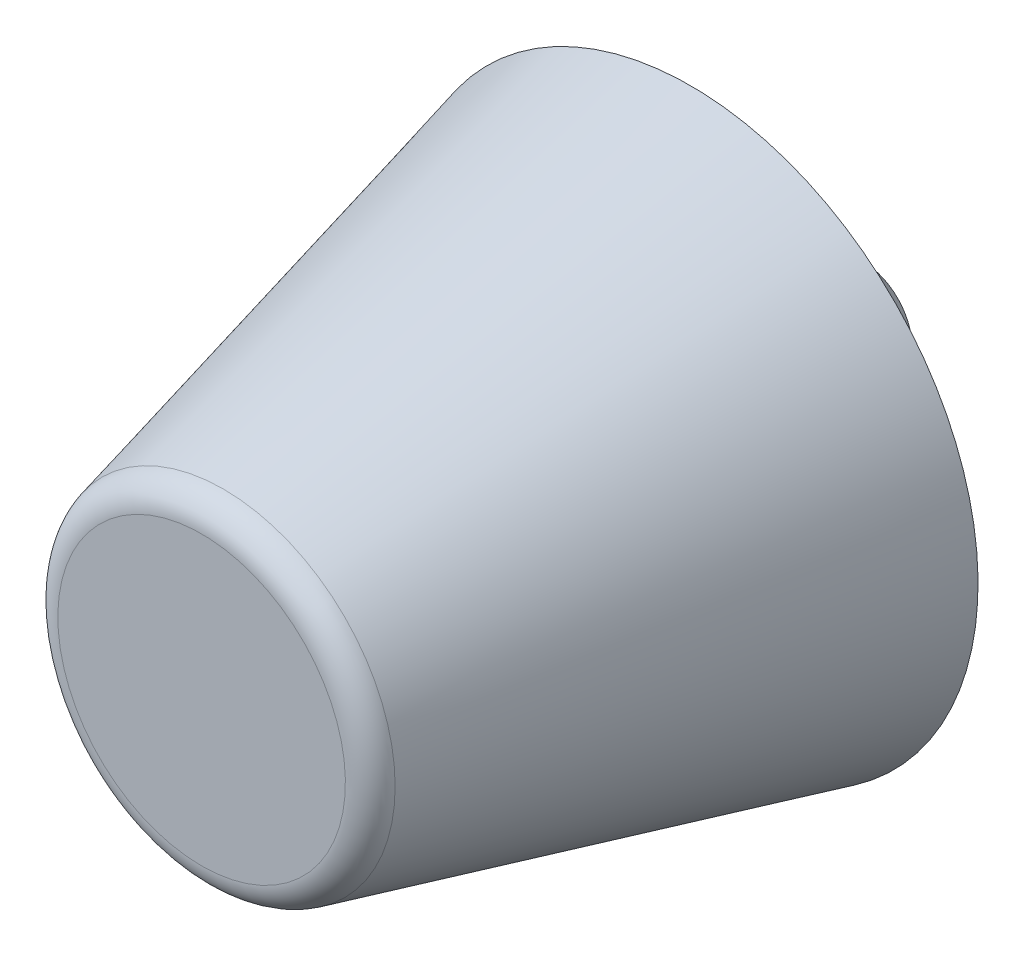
ISO-10303-21;
HEADER;
FILE_DESCRIPTION(('STEP AP214'),'2;1');
FILE_NAME('part.step','',(''),(''),'','','');
FILE_SCHEMA(('AUTOMOTIVE_DESIGN { 1 0 10303 214 1 1 1 1 }'));
ENDSEC;
DATA;
#1=APPLICATION_CONTEXT('core data for automotive mechanical design processes');
#2=APPLICATION_PROTOCOL_DEFINITION('international standard','automotive_design',2000,#1);
#3=PRODUCT_CONTEXT('',#1,'mechanical');
#4=PRODUCT('Part','Part','',(#3));
#5=PRODUCT_RELATED_PRODUCT_CATEGORY('part','',(#4));
#6=PRODUCT_DEFINITION_FORMATION('','',#4);
#7=PRODUCT_DEFINITION_CONTEXT('part definition',#1,'design');
#8=PRODUCT_DEFINITION('design','',#6,#7);
#9=PRODUCT_DEFINITION_SHAPE('','',#8);
#10=(LENGTH_UNIT() NAMED_UNIT(*) SI_UNIT(.MILLI.,.METRE.));
#11=(NAMED_UNIT(*) PLANE_ANGLE_UNIT() SI_UNIT($,.RADIAN.));
#12=(NAMED_UNIT(*) SI_UNIT($,.STERADIAN.) SOLID_ANGLE_UNIT());
#13=UNCERTAINTY_MEASURE_WITH_UNIT(LENGTH_MEASURE(1.E-05),#10,'distance_accuracy_value','');
#14=(GEOMETRIC_REPRESENTATION_CONTEXT(3) GLOBAL_UNCERTAINTY_ASSIGNED_CONTEXT((#13)) GLOBAL_UNIT_ASSIGNED_CONTEXT((#10,
#11,#12)) REPRESENTATION_CONTEXT('',''));
#15=CARTESIAN_POINT('',(0.,0.,0.));
#16=DIRECTION('',(0.,0.,1.));
#17=DIRECTION('',(1.,0.,0.));
#18=AXIS2_PLACEMENT_3D('',#15,#16,#17);
#19=CARTESIAN_POINT('',(0.,0.,17.));
#20=DIRECTION('',(0.,0.,1.));
#21=DIRECTION('',(0.,-1.,0.));
#22=AXIS2_PLACEMENT_3D('',#19,#20,#21);
#23=CYLINDRICAL_SURFACE('',#22,9.);
#24=CARTESIAN_POINT('',(0.,0.,0.));
#25=DIRECTION('',(0.,0.,1.));
#26=DIRECTION('',(0.,-1.,0.));
#27=AXIS2_PLACEMENT_3D('',#24,#25,#26);
#28=CIRCLE('',#27,9.);
#29=CARTESIAN_POINT('',(0.,-9.,0.));
#30=VERTEX_POINT('',#29);
#31=EDGE_CURVE('E27',#30,#30,#28,.T.);
#32=ORIENTED_EDGE('',*,*,#31,.F.);
#33=EDGE_LOOP('',(#32));
#34=FACE_BOUND('',#33,.T.);
#35=CARTESIAN_POINT('',(0.,0.,0.0500000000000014));
#36=DIRECTION('',(0.,0.,1.));
#37=DIRECTION('',(0.,-1.,0.));
#38=AXIS2_PLACEMENT_3D('',#35,#36,#37);
#39=CIRCLE('',#38,9.);
#40=CARTESIAN_POINT('',(0.,-9.,0.0500000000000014));
#41=VERTEX_POINT('',#40);
#42=EDGE_CURVE('E44',#41,#41,#39,.T.);
#43=ORIENTED_EDGE('',*,*,#42,.T.);
#44=EDGE_LOOP('',(#43));
#45=FACE_BOUND('',#44,.T.);
#46=ADVANCED_FACE('F12',(#34,#45),#23,.F.);
#47=CARTESIAN_POINT('',(9.,0.,0.));
#48=DIRECTION('',(0.,0.,1.));
#49=DIRECTION('',(0.,-1.,0.));
#50=AXIS2_PLACEMENT_3D('',#47,#48,#49);
#51=PLANE('',#50);
#52=CARTESIAN_POINT('',(0.,0.,0.));
#53=DIRECTION('',(0.,0.,1.));
#54=DIRECTION('',(0.,-1.,0.));
#55=AXIS2_PLACEMENT_3D('',#52,#53,#54);
#56=CIRCLE('',#55,10.);
#57=CARTESIAN_POINT('',(0.,-10.,0.));
#58=VERTEX_POINT('',#57);
#59=EDGE_CURVE('E32',#58,#58,#56,.T.);
#60=ORIENTED_EDGE('',*,*,#59,.F.);
#61=EDGE_LOOP('',(#60));
#62=FACE_BOUND('',#61,.T.);
#63=ORIENTED_EDGE('',*,*,#31,.T.);
#64=EDGE_LOOP('',(#63));
#65=FACE_BOUND('',#64,.T.);
#66=ADVANCED_FACE('F72',(#62,#65),#51,.F.);
#67=CARTESIAN_POINT('',(0.,0.,0.));
#68=DIRECTION('',(0.,0.,-1.));
#69=DIRECTION('',(0.,1.,0.));
#70=AXIS2_PLACEMENT_3D('',#67,#68,#69);
#71=CONICAL_SURFACE('',#70,10.,0.243194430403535);
#72=CARTESIAN_POINT('',(0.,0.,16.2408042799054));
#73=DIRECTION('',(0.,0.,1.));
#74=DIRECTION('',(0.,-1.,0.));
#75=AXIS2_PLACEMENT_3D('',#72,#73,#74);
#76=CIRCLE('',#75,5.97057369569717);
#77=CARTESIAN_POINT('',(0.,-5.97057369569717,16.2408042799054));
#78=VERTEX_POINT('',#77);
#79=EDGE_CURVE('E35',#78,#78,#76,.T.);
#80=ORIENTED_EDGE('',*,*,#79,.F.);
#81=EDGE_LOOP('',(#80));
#82=FACE_BOUND('',#81,.T.);
#83=ORIENTED_EDGE('',*,*,#59,.T.);
#84=EDGE_LOOP('',(#83));
#85=FACE_BOUND('',#84,.T.);
#86=ADVANCED_FACE('F77',(#82,#85),#71,.T.);
#87=CARTESIAN_POINT('',(0.,0.,16.));
#88=DIRECTION('',(0.,0.,1.));
#89=DIRECTION('',(0.,-1.,0.));
#90=AXIS2_PLACEMENT_3D('',#87,#88,#89);
#91=TOROIDAL_SURFACE('',#90,5.,1.);
#92=ORIENTED_EDGE('',*,*,#79,.T.);
#93=EDGE_LOOP('',(#92));
#94=FACE_BOUND('',#93,.T.);
#95=CARTESIAN_POINT('',(0.,0.,17.));
#96=DIRECTION('',(0.,0.,1.));
#97=DIRECTION('',(0.,-1.,0.));
#98=AXIS2_PLACEMENT_3D('',#95,#96,#97);
#99=CIRCLE('',#98,5.);
#100=CARTESIAN_POINT('',(0.,-5.,17.));
#101=VERTEX_POINT('',#100);
#102=EDGE_CURVE('E38',#101,#101,#99,.T.);
#103=ORIENTED_EDGE('',*,*,#102,.F.);
#104=EDGE_LOOP('',(#103));
#105=FACE_BOUND('',#104,.T.);
#106=ADVANCED_FACE('F84',(#94,#105),#91,.T.);
#107=CARTESIAN_POINT('',(5.,0.,17.));
#108=DIRECTION('',(0.,0.,-1.));
#109=DIRECTION('',(0.,1.,0.));
#110=AXIS2_PLACEMENT_3D('',#107,#108,#109);
#111=PLANE('',#110);
#112=ORIENTED_EDGE('',*,*,#102,.T.);
#113=EDGE_LOOP('',(#112));
#114=FACE_BOUND('',#113,.T.);
#115=ADVANCED_FACE('F59',(#114),#111,.F.);
#116=CARTESIAN_POINT('',(0.,0.,0.));
#117=DIRECTION('',(0.,0.,1.));
#118=DIRECTION('',(0.,-1.,0.));
#119=AXIS2_PLACEMENT_3D('',#116,#117,#118);
#120=PLANE('',#119);
#121=CARTESIAN_POINT('',(0.,0.,0.));
#122=DIRECTION('',(0.,0.,1.));
#123=DIRECTION('',(0.,-1.,0.));
#124=AXIS2_PLACEMENT_3D('',#121,#122,#123);
#125=CIRCLE('',#124,8.95);
#126=CARTESIAN_POINT('',(0.,-8.95,0.));
#127=VERTEX_POINT('',#126);
#128=EDGE_CURVE('E41',#127,#127,#125,.T.);
#129=ORIENTED_EDGE('',*,*,#128,.F.);
#130=EDGE_LOOP('',(#129));
#131=FACE_BOUND('',#130,.T.);
#132=CARTESIAN_POINT('',(0.,0.,0.));
#133=DIRECTION('',(0.,0.,1.));
#134=DIRECTION('',(0.,-1.,0.));
#135=AXIS2_PLACEMENT_3D('',#132,#133,#134);
#136=CIRCLE('',#135,2.5);
#137=CARTESIAN_POINT('',(0.,-2.5,0.));
#138=VERTEX_POINT('',#137);
#139=EDGE_CURVE('E23',#138,#138,#136,.T.);
#140=ORIENTED_EDGE('',*,*,#139,.T.);
#141=EDGE_LOOP('',(#140));
#142=FACE_BOUND('',#141,.T.);
#143=ADVANCED_FACE('F53',(#131,#142),#120,.F.);
#144=CARTESIAN_POINT('',(0.,0.,0.));
#145=DIRECTION('',(0.,0.,1.));
#146=DIRECTION('',(0.,-1.,0.));
#147=AXIS2_PLACEMENT_3D('',#144,#145,#146);
#148=CONICAL_SURFACE('',#147,8.95,0.785398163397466);
#149=ORIENTED_EDGE('',*,*,#42,.F.);
#150=EDGE_LOOP('',(#149));
#151=FACE_BOUND('',#150,.T.);
#152=ORIENTED_EDGE('',*,*,#128,.T.);
#153=EDGE_LOOP('',(#152));
#154=FACE_BOUND('',#153,.T.);
#155=ADVANCED_FACE('F49',(#151,#154),#148,.T.);
#156=CARTESIAN_POINT('',(0.,0.,17.));
#157=DIRECTION('',(0.,0.,1.));
#158=DIRECTION('',(0.,-1.,0.));
#159=AXIS2_PLACEMENT_3D('',#156,#157,#158);
#160=CYLINDRICAL_SURFACE('',#159,2.5);
#161=CARTESIAN_POINT('',(0.,0.,-5.2));
#162=DIRECTION('',(0.,0.,1.));
#163=DIRECTION('',(0.,-1.,0.));
#164=AXIS2_PLACEMENT_3D('',#161,#162,#163);
#165=CIRCLE('',#164,2.5);
#166=CARTESIAN_POINT('',(0.,-2.5,-5.2));
#167=VERTEX_POINT('',#166);
#168=EDGE_CURVE('E8',#167,#167,#165,.T.);
#169=ORIENTED_EDGE('',*,*,#168,.T.);
#170=EDGE_LOOP('',(#169));
#171=FACE_BOUND('',#170,.T.);
#172=ORIENTED_EDGE('',*,*,#139,.F.);
#173=EDGE_LOOP('',(#172));
#174=FACE_BOUND('',#173,.T.);
#175=ADVANCED_FACE('F52',(#171,#174),#160,.T.);
#176=CARTESIAN_POINT('',(0.,0.,-6.));
#177=DIRECTION('',(0.,0.,1.));
#178=DIRECTION('',(0.,-1.,0.));
#179=AXIS2_PLACEMENT_3D('',#176,#177,#178);
#180=PLANE('',#179);
#181=CARTESIAN_POINT('',(0.,0.,-6.));
#182=DIRECTION('',(0.,0.,1.));
#183=DIRECTION('',(0.,-1.,0.));
#184=AXIS2_PLACEMENT_3D('',#181,#182,#183);
#185=CIRCLE('',#184,1.7);
#186=CARTESIAN_POINT('',(0.,-1.7,-6.));
#187=VERTEX_POINT('',#186);
#188=EDGE_CURVE('E19',#187,#187,#185,.F.);
#189=ORIENTED_EDGE('',*,*,#188,.T.);
#190=EDGE_LOOP('',(#189));
#191=FACE_BOUND('',#190,.T.);
#192=ADVANCED_FACE('F64',(#191),#180,.F.);
#193=CARTESIAN_POINT('',(0.,0.,-6.));
#194=DIRECTION('',(0.,0.,1.));
#195=DIRECTION('',(0.,-1.,0.));
#196=AXIS2_PLACEMENT_3D('',#193,#194,#195);
#197=CONICAL_SURFACE('',#196,1.7,0.785398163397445);
#198=ORIENTED_EDGE('',*,*,#168,.F.);
#199=EDGE_LOOP('',(#198));
#200=FACE_BOUND('',#199,.T.);
#201=ORIENTED_EDGE('',*,*,#188,.F.);
#202=EDGE_LOOP('',(#201));
#203=FACE_BOUND('',#202,.T.);
#204=ADVANCED_FACE('F14',(#200,#203),#197,.T.);
#205=CLOSED_SHELL('',(#46,#66,#86,#106,#115,#143,#155,#175,#192,#204));
#206=MANIFOLD_SOLID_BREP('B1',#205);
#207=ADVANCED_BREP_SHAPE_REPRESENTATION('',(#18,#206),#14);
#208=SHAPE_DEFINITION_REPRESENTATION(#9,#207);
ENDSEC;
END-ISO-10303-21;
